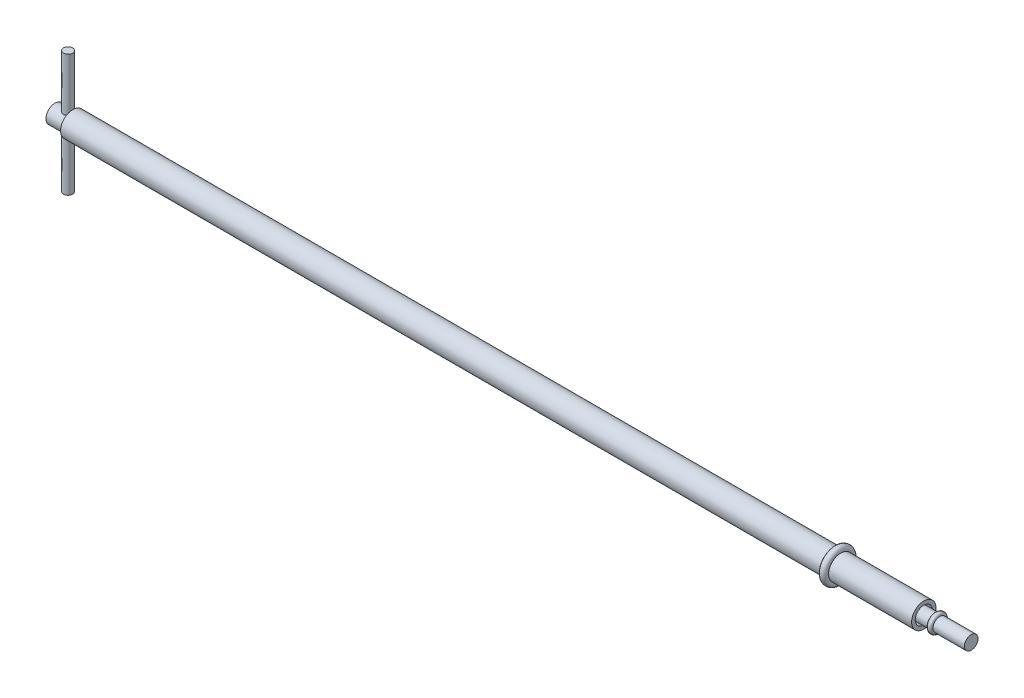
ISO-10303-21;
HEADER;
FILE_DESCRIPTION(('STEP AP214'),'2;1');
FILE_NAME('part.step','',(''),(''),'','','');
FILE_SCHEMA(('AUTOMOTIVE_DESIGN { 1 0 10303 214 1 1 1 1 }'));
ENDSEC;
DATA;
#1=APPLICATION_CONTEXT('core data for automotive mechanical design processes');
#2=APPLICATION_PROTOCOL_DEFINITION('international standard','automotive_design',2000,#1);
#3=PRODUCT_CONTEXT('',#1,'mechanical');
#4=PRODUCT('Part','Part','',(#3));
#5=PRODUCT_RELATED_PRODUCT_CATEGORY('part','',(#4));
#6=PRODUCT_DEFINITION_FORMATION('','',#4);
#7=PRODUCT_DEFINITION_CONTEXT('part definition',#1,'design');
#8=PRODUCT_DEFINITION('design','',#6,#7);
#9=PRODUCT_DEFINITION_SHAPE('','',#8);
#10=(LENGTH_UNIT() NAMED_UNIT(*) SI_UNIT(.MILLI.,.METRE.));
#11=(NAMED_UNIT(*) PLANE_ANGLE_UNIT() SI_UNIT($,.RADIAN.));
#12=(NAMED_UNIT(*) SI_UNIT($,.STERADIAN.) SOLID_ANGLE_UNIT());
#13=UNCERTAINTY_MEASURE_WITH_UNIT(LENGTH_MEASURE(1.E-05),#10,'distance_accuracy_value','');
#14=(GEOMETRIC_REPRESENTATION_CONTEXT(3) GLOBAL_UNCERTAINTY_ASSIGNED_CONTEXT((#13)) GLOBAL_UNIT_ASSIGNED_CONTEXT((#10,
#11,#12)) REPRESENTATION_CONTEXT('',''));
#15=CARTESIAN_POINT('',(0.,0.,0.));
#16=DIRECTION('',(0.,0.,1.));
#17=DIRECTION('',(1.,0.,0.));
#18=AXIS2_PLACEMENT_3D('',#15,#16,#17);
#19=CARTESIAN_POINT('',(0.,0.,0.));
#20=DIRECTION('',(1.,0.,0.));
#21=DIRECTION('',(0.,0.,-1.));
#22=AXIS2_PLACEMENT_3D('',#19,#20,#21);
#23=PLANE('',#22);
#24=CARTESIAN_POINT('',(0.,0.,0.));
#25=DIRECTION('',(-1.,0.,0.));
#26=DIRECTION('',(0.,0.,1.));
#27=AXIS2_PLACEMENT_3D('',#24,#25,#26);
#28=CIRCLE('',#27,2.96848884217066);
#29=CARTESIAN_POINT('',(0.,0.,2.96848884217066));
#30=VERTEX_POINT('',#29);
#31=EDGE_CURVE('E9',#30,#30,#28,.T.);
#32=ORIENTED_EDGE('',*,*,#31,.T.);
#33=EDGE_LOOP('',(#32));
#34=FACE_BOUND('',#33,.T.);
#35=ADVANCED_FACE('F14',(#34),#23,.F.);
#36=CARTESIAN_POINT('',(0.,0.,0.));
#37=DIRECTION('',(-1.,0.,0.));
#38=DIRECTION('',(0.,0.,1.));
#39=AXIS2_PLACEMENT_3D('',#36,#37,#38);
#40=CYLINDRICAL_SURFACE('',#39,2.96848884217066);
#41=CARTESIAN_POINT('',(4.2661907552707,-2.56162565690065,1.5));
#42=CARTESIAN_POINT('',(4.34422264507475,-2.56163267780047,1.4999944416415));
#43=CARTESIAN_POINT('',(4.42235011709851,-2.5652455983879,1.49387019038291));
#44=CARTESIAN_POINT('',(4.57619660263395,-2.57917019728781,1.46969018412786));
#45=CARTESIAN_POINT('',(4.65191032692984,-2.58949565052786,1.45160989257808));
#46=CARTESIAN_POINT('',(4.7984121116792,-2.61534051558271,1.40450365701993));
#47=CARTESIAN_POINT('',(4.86922439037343,-2.63083180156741,1.37553687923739));
#48=CARTESIAN_POINT('',(5.00496574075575,-2.66521903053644,1.3076607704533));
#49=CARTESIAN_POINT('',(5.06989438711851,-2.68411521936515,1.26875072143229));
#50=CARTESIAN_POINT('',(5.1980701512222,-2.72512943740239,1.17824574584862));
#51=CARTESIAN_POINT('',(5.26071360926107,-2.74738478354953,1.12585775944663));
#52=CARTESIAN_POINT('',(5.37679616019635,-2.79150219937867,1.01153200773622));
#53=CARTESIAN_POINT('',(5.43023057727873,-2.81336406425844,0.949589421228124));
#54=CARTESIAN_POINT('',(5.53000027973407,-2.85604040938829,0.812675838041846));
#55=CARTESIAN_POINT('',(5.57558830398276,-2.87667768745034,0.737099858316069));
#56=CARTESIAN_POINT('',(5.65312694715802,-2.91278858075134,0.57811281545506));
#57=CARTESIAN_POINT('',(5.68508635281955,-2.92826552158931,0.494706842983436));
#58=CARTESIAN_POINT('',(5.73205409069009,-2.95132082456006,0.328826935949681));
#59=CARTESIAN_POINT('',(5.74812234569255,-2.95939000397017,0.246722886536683));
#60=CARTESIAN_POINT('',(5.76634693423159,-2.96855664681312,0.0806187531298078));
#61=CARTESIAN_POINT('',(5.76851189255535,-2.96965843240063,-0.00338012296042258));
#62=CARTESIAN_POINT('',(5.75926674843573,-2.96499461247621,-0.162900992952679));
#63=CARTESIAN_POINT('',(5.74904466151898,-2.95982995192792,-0.238513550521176));
#64=CARTESIAN_POINT('',(5.71744812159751,-2.94412744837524,-0.386779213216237));
#65=CARTESIAN_POINT('',(5.69607283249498,-2.93358920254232,-0.459432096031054));
#66=CARTESIAN_POINT('',(5.64265046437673,-2.90792243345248,-0.600967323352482));
#67=CARTESIAN_POINT('',(5.6104622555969,-2.89273345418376,-0.669784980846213));
#68=CARTESIAN_POINT('',(5.53652935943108,-2.85912624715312,-0.801205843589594));
#69=CARTESIAN_POINT('',(5.49478127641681,-2.84070687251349,-0.863806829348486));
#70=CARTESIAN_POINT('',(5.39831355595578,-2.80027310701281,-0.987431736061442));
#71=CARTESIAN_POINT('',(5.34273339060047,-2.77808334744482,-1.04772730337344));
#72=CARTESIAN_POINT('',(5.22247589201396,-2.73373058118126,-1.15853905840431));
#73=CARTESIAN_POINT('',(5.15779137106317,-2.711567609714,-1.20904744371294));
#74=CARTESIAN_POINT('',(5.01595350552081,-2.66818702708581,-1.30211863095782));
#75=CARTESIAN_POINT('',(4.93825943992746,-2.64712790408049,-1.34393869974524));
#76=CARTESIAN_POINT('',(4.77563373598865,-2.61059724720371,-1.41360191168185));
#77=CARTESIAN_POINT('',(4.69070988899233,-2.59511979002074,-1.44145988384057));
#78=CARTESIAN_POINT('',(4.52314660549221,-2.5732516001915,-1.48012245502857));
#79=CARTESIAN_POINT('',(4.44086504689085,-2.5662346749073,-1.4921098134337));
#80=CARTESIAN_POINT('',(4.27518725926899,-2.56030791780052,-1.50226241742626));
#81=CARTESIAN_POINT('',(4.19179190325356,-2.56139207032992,-1.50043791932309));
#82=CARTESIAN_POINT('',(4.0363004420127,-2.57088003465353,-1.48410429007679));
#83=CARTESIAN_POINT('',(3.96399155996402,-2.57844372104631,-1.47105036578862));
#84=CARTESIAN_POINT('',(3.82273455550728,-2.5987858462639,-1.43480545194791));
#85=CARTESIAN_POINT('',(3.75378756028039,-2.61156602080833,-1.4116110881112));
#86=CARTESIAN_POINT('',(3.61758262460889,-2.64158935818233,-1.35462537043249));
#87=CARTESIAN_POINT('',(3.55054962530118,-2.65901132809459,-1.32039421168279));
#88=CARTESIAN_POINT('',(3.4227891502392,-2.69620279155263,-1.24268708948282));
#89=CARTESIAN_POINT('',(3.36206494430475,-2.71597349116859,-1.19920636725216));
#90=CARTESIAN_POINT('',(3.24042974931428,-2.75870627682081,-1.09766735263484));
#91=CARTESIAN_POINT('',(3.18050972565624,-2.78175048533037,-1.03845113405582));
#92=CARTESIAN_POINT('',(3.07113715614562,-2.82623083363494,-0.910458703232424));
#93=CARTESIAN_POINT('',(3.02168838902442,-2.84766639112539,-0.841679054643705));
#94=CARTESIAN_POINT('',(2.93345142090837,-2.88730330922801,-0.693843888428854));
#95=CARTESIAN_POINT('',(2.89500808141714,-2.90539479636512,-0.61455096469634));
#96=CARTESIAN_POINT('',(2.83239387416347,-2.93546253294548,-0.449446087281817));
#97=CARTESIAN_POINT('',(2.80821021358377,-2.94744426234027,-0.363640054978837));
#98=CARTESIAN_POINT('',(2.77692709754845,-2.96305064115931,-0.196555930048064));
#99=CARTESIAN_POINT('',(2.76844828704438,-2.96734871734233,-0.115598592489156));
#100=CARTESIAN_POINT('',(2.76472481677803,-2.96922900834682,0.046686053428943));
#101=CARTESIAN_POINT('',(2.76947531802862,-2.96681367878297,0.128013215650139));
#102=CARTESIAN_POINT('',(2.79117351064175,-2.95593044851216,0.282881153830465));
#103=CARTESIAN_POINT('',(2.80726716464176,-2.94788661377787,0.356574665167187));
#104=CARTESIAN_POINT('',(2.8500269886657,-2.92696073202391,0.500089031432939));
#105=CARTESIAN_POINT('',(2.87669464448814,-2.91407800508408,0.569909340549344));
#106=CARTESIAN_POINT('',(2.94100554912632,-2.88395591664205,0.70700699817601));
#107=CARTESIAN_POINT('',(2.97906392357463,-2.86655585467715,0.774053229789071));
#108=CARTESIAN_POINT('',(3.06455784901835,-2.82919949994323,0.901081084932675));
#109=CARTESIAN_POINT('',(3.11199768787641,-2.80924203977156,0.961059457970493));
#110=CARTESIAN_POINT('',(3.2204757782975,-2.76635443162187,1.0786621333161));
#111=CARTESIAN_POINT('',(3.28240495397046,-2.74332800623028,1.13543169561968));
#112=CARTESIAN_POINT('',(3.41521608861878,-2.69855126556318,1.23810027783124));
#113=CARTESIAN_POINT('',(3.48610617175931,-2.67680213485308,1.28398932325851));
#114=CARTESIAN_POINT('',(3.63807370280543,-2.63645767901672,1.36496837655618));
#115=CARTESIAN_POINT('',(3.71942032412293,-2.61799889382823,1.39962566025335));
#116=CARTESIAN_POINT('',(3.88798624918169,-2.5880823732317,1.45421765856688));
#117=CARTESIAN_POINT('',(3.97518486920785,-2.57660128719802,1.47420152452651));
#118=CARTESIAN_POINT('',(4.09717142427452,-2.56697512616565,1.49083314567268));
#119=CARTESIAN_POINT('',(4.13084530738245,-2.56497652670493,1.49426512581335));
#120=CARTESIAN_POINT('',(4.1984036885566,-2.56230022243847,1.49884983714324));
#121=CARTESIAN_POINT('',(4.23228820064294,-2.56162260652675,1.50000241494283));
#122=CARTESIAN_POINT('',(4.2661907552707,-2.56162565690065,1.5));
#123=B_SPLINE_CURVE_WITH_KNOTS('',3,(#41,#42,#43,#44,#45,#46,#47,#48,#49,#50,#51,#52,#53,#54,
#55,#56,#57,#58,#59,#60,#61,#62,#63,#64,#65,#66,#67,#68,#69,#70,#71,#72,#73,#74,#75,#76,#77,#78,
#79,#80,#81,#82,#83,#84,#85,#86,#87,#88,#89,#90,#91,#92,#93,#94,#95,#96,#97,#98,#99,#100,#101,
#102,#103,#104,#105,#106,#107,#108,#109,#110,#111,#112,#113,#114,#115,#116,#117,#118,#119,#120,
#121,#122),.UNSPECIFIED.,.T.,.F.,(4,2,2,2,2,2,2,2,2,2,2,2,2,2,2,2,2,2,2,2,2,2,2,2,2,2,2,2,2,2,2,
2,2,2,2,2,2,2,2,2,4),(0.,0.233952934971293,0.468387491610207,0.701565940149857,
0.934761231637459,1.18762397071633,1.44061472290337,1.71111458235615,1.98143977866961,
2.2321892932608,2.48278324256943,2.71113163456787,2.93949714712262,3.17096723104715,
3.40251966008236,3.65630154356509,3.91028491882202,4.18100181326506,4.45143056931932,
4.70029410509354,4.94897285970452,5.16957851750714,5.39025763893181,5.62112511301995,
5.85211165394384,6.11296325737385,6.37390883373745,6.64230820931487,6.91046642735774,
7.15369256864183,7.39682975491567,7.62338321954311,7.84996852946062,8.08610136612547,
8.32234237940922,8.58252752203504,8.8429502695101,9.1124607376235,9.38106425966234,
9.48270307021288,9.58434872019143),.UNSPECIFIED.);
#124=CARTESIAN_POINT('',(4.2661907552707,-2.56162565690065,1.5));
#125=VERTEX_POINT('',#124);
#126=EDGE_CURVE('E17',#125,#125,#123,.T.);
#127=ORIENTED_EDGE('',*,*,#126,.T.);
#128=EDGE_LOOP('',(#127));
#129=FACE_BOUND('',#128,.T.);
#130=CARTESIAN_POINT('',(4.2661907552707,2.56162565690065,1.5));
#131=CARTESIAN_POINT('',(4.18815886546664,2.56163267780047,1.4999944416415));
#132=CARTESIAN_POINT('',(4.11003139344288,2.5652455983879,1.49387019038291));
#133=CARTESIAN_POINT('',(3.95618490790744,2.57917019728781,1.46969018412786));
#134=CARTESIAN_POINT('',(3.88047118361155,2.58949565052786,1.45160989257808));
#135=CARTESIAN_POINT('',(3.73396939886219,2.61534051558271,1.40450365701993));
#136=CARTESIAN_POINT('',(3.66315712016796,2.63083180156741,1.37553687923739));
#137=CARTESIAN_POINT('',(3.52741576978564,2.66521903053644,1.3076607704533));
#138=CARTESIAN_POINT('',(3.46248712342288,2.68411521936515,1.26875072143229));
#139=CARTESIAN_POINT('',(3.33431135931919,2.72512943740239,1.17824574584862));
#140=CARTESIAN_POINT('',(3.27166790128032,2.74738478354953,1.12585775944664));
#141=CARTESIAN_POINT('',(3.15558535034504,2.79150219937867,1.01153200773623));
#142=CARTESIAN_POINT('',(3.10215093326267,2.81336406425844,0.949589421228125));
#143=CARTESIAN_POINT('',(3.00238123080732,2.85604040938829,0.812675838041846));
#144=CARTESIAN_POINT('',(2.95679320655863,2.87667768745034,0.73709985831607));
#145=CARTESIAN_POINT('',(2.87925456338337,2.91278858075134,0.578112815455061));
#146=CARTESIAN_POINT('',(2.84729515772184,2.92826552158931,0.494706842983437));
#147=CARTESIAN_POINT('',(2.8003274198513,2.95132082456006,0.328826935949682));
#148=CARTESIAN_POINT('',(2.78425916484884,2.95939000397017,0.246722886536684));
#149=CARTESIAN_POINT('',(2.7660345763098,2.96855664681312,0.0806187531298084));
#150=CARTESIAN_POINT('',(2.76386961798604,2.96965843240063,-0.00338012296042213));
#151=CARTESIAN_POINT('',(2.77311476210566,2.96499461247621,-0.162900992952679));
#152=CARTESIAN_POINT('',(2.78333684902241,2.95982995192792,-0.238513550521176));
#153=CARTESIAN_POINT('',(2.81493338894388,2.94412744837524,-0.386779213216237));
#154=CARTESIAN_POINT('',(2.83630867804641,2.93358920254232,-0.459432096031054));
#155=CARTESIAN_POINT('',(2.88973104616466,2.90792243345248,-0.600967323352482));
#156=CARTESIAN_POINT('',(2.92191925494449,2.89273345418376,-0.669784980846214));
#157=CARTESIAN_POINT('',(2.99585215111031,2.85912624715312,-0.801205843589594));
#158=CARTESIAN_POINT('',(3.03760023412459,2.84070687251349,-0.863806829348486));
#159=CARTESIAN_POINT('',(3.13406795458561,2.80027310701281,-0.987431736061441));
#160=CARTESIAN_POINT('',(3.18964811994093,2.77808334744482,-1.04772730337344));
#161=CARTESIAN_POINT('',(3.30990561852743,2.73373058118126,-1.15853905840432));
#162=CARTESIAN_POINT('',(3.37459013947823,2.711567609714,-1.20904744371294));
#163=CARTESIAN_POINT('',(3.51642800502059,2.66818702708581,-1.30211863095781));
#164=CARTESIAN_POINT('',(3.59412207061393,2.64712790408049,-1.34393869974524));
#165=CARTESIAN_POINT('',(3.75674777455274,2.6105972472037,-1.41360191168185));
#166=CARTESIAN_POINT('',(3.84167162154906,2.59511979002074,-1.44145988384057));
#167=CARTESIAN_POINT('',(4.00923490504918,2.5732516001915,-1.48012245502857));
#168=CARTESIAN_POINT('',(4.09151646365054,2.5662346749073,-1.4921098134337));
#169=CARTESIAN_POINT('',(4.2571942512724,2.56030791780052,-1.50226241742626));
#170=CARTESIAN_POINT('',(4.34058960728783,2.56139207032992,-1.50043791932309));
#171=CARTESIAN_POINT('',(4.49608106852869,2.57088003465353,-1.48410429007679));
#172=CARTESIAN_POINT('',(4.56838995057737,2.57844372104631,-1.47105036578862));
#173=CARTESIAN_POINT('',(4.70964695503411,2.59878584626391,-1.43480545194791));
#174=CARTESIAN_POINT('',(4.77859395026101,2.61156602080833,-1.4116110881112));
#175=CARTESIAN_POINT('',(4.9147988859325,2.64158935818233,-1.35462537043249));
#176=CARTESIAN_POINT('',(4.98183188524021,2.65901132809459,-1.32039421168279));
#177=CARTESIAN_POINT('',(5.10959236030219,2.69620279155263,-1.24268708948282));
#178=CARTESIAN_POINT('',(5.17031656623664,2.71597349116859,-1.19920636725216));
#179=CARTESIAN_POINT('',(5.29195176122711,2.75870627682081,-1.09766735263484));
#180=CARTESIAN_POINT('',(5.35187178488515,2.78175048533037,-1.03845113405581));
#181=CARTESIAN_POINT('',(5.46124435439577,2.82623083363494,-0.910458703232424));
#182=CARTESIAN_POINT('',(5.51069312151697,2.84766639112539,-0.841679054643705));
#183=CARTESIAN_POINT('',(5.59893008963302,2.88730330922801,-0.693843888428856));
#184=CARTESIAN_POINT('',(5.63737342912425,2.90539479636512,-0.614550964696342));
#185=CARTESIAN_POINT('',(5.69998763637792,2.93546253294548,-0.449446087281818));
#186=CARTESIAN_POINT('',(5.72417129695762,2.94744426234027,-0.363640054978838));
#187=CARTESIAN_POINT('',(5.75545441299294,2.96305064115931,-0.196555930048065));
#188=CARTESIAN_POINT('',(5.76393322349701,2.96734871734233,-0.115598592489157));
#189=CARTESIAN_POINT('',(5.76765669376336,2.96922900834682,0.0466860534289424));
#190=CARTESIAN_POINT('',(5.76290619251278,2.96681367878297,0.128013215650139));
#191=CARTESIAN_POINT('',(5.74120799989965,2.95593044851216,0.282881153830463));
#192=CARTESIAN_POINT('',(5.72511434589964,2.94788661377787,0.356574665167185));
#193=CARTESIAN_POINT('',(5.68235452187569,2.92696073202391,0.500089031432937));
#194=CARTESIAN_POINT('',(5.65568686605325,2.91407800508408,0.569909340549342));
#195=CARTESIAN_POINT('',(5.59137596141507,2.88395591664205,0.707006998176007));
#196=CARTESIAN_POINT('',(5.55331758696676,2.86655585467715,0.774053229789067));
#197=CARTESIAN_POINT('',(5.46782366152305,2.82919949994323,0.901081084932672));
#198=CARTESIAN_POINT('',(5.42038382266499,2.80924203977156,0.961059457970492));
#199=CARTESIAN_POINT('',(5.3119057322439,2.76635443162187,1.0786621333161));
#200=CARTESIAN_POINT('',(5.24997655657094,2.74332800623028,1.13543169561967));
#201=CARTESIAN_POINT('',(5.11716542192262,2.69855126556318,1.23810027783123));
#202=CARTESIAN_POINT('',(5.04627533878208,2.67680213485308,1.28398932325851));
#203=CARTESIAN_POINT('',(4.89430780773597,2.63645767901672,1.36496837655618));
#204=CARTESIAN_POINT('',(4.81296118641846,2.61799889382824,1.39962566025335));
#205=CARTESIAN_POINT('',(4.6443952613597,2.5880823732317,1.45421765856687));
#206=CARTESIAN_POINT('',(4.55719664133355,2.57660128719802,1.47420152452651));
#207=CARTESIAN_POINT('',(4.43521008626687,2.56697512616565,1.49083314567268));
#208=CARTESIAN_POINT('',(4.40153620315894,2.56497652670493,1.49426512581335));
#209=CARTESIAN_POINT('',(4.33397782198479,2.56230022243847,1.49884983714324));
#210=CARTESIAN_POINT('',(4.30009330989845,2.56162260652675,1.50000241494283));
#211=CARTESIAN_POINT('',(4.2661907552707,2.56162565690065,1.5));
#212=B_SPLINE_CURVE_WITH_KNOTS('',3,(#130,#131,#132,#133,#134,#135,#136,#137,#138,#139,#140,
#141,#142,#143,#144,#145,#146,#147,#148,#149,#150,#151,#152,#153,#154,#155,#156,#157,#158,#159,
#160,#161,#162,#163,#164,#165,#166,#167,#168,#169,#170,#171,#172,#173,#174,#175,#176,#177,#178,
#179,#180,#181,#182,#183,#184,#185,#186,#187,#188,#189,#190,#191,#192,#193,#194,#195,#196,#197,
#198,#199,#200,#201,#202,#203,#204,#205,#206,#207,#208,#209,#210,#211),.UNSPECIFIED.,.T.,.F.,(4,
2,2,2,2,2,2,2,2,2,2,2,2,2,2,2,2,2,2,2,2,2,2,2,2,2,2,2,2,2,2,2,2,2,2,2,2,2,2,2,4),(0.,
0.233952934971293,0.468387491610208,0.701565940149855,0.934761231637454,1.18762397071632,
1.44061472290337,1.71111458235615,1.98143977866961,2.2321892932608,2.48278324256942,
2.71113163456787,2.93949714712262,3.17096723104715,3.40251966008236,3.65630154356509,
3.91028491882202,4.18100181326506,4.45143056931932,4.70029410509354,4.94897285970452,
5.16957851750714,5.39025763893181,5.62112511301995,5.85211165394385,6.11296325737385,
6.37390883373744,6.64230820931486,6.91046642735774,7.15369256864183,7.39682975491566,
7.62338321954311,7.84996852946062,8.08610136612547,8.32234237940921,8.58252752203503,
8.8429502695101,9.1124607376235,9.38106425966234,9.48270307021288,9.58434872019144),.UNSPECIFIED.);
#213=CARTESIAN_POINT('',(4.2661907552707,2.56162565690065,1.5));
#214=VERTEX_POINT('',#213);
#215=EDGE_CURVE('E33',#214,#214,#212,.T.);
#216=ORIENTED_EDGE('',*,*,#215,.T.);
#217=EDGE_LOOP('',(#216));
#218=FACE_BOUND('',#217,.T.);
#219=ORIENTED_EDGE('',*,*,#31,.F.);
#220=EDGE_LOOP('',(#219));
#221=FACE_BOUND('',#220,.T.);
#222=CARTESIAN_POINT('',(5.7989899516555,0.,0.));
#223=DIRECTION('',(-1.,0.,0.));
#224=DIRECTION('',(0.,0.,1.));
#225=AXIS2_PLACEMENT_3D('',#222,#223,#224);
#226=CIRCLE('',#225,2.96848884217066);
#227=CARTESIAN_POINT('',(5.7989899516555,0.,2.96848884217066));
#228=VERTEX_POINT('',#227);
#229=EDGE_CURVE('E25',#228,#228,#226,.T.);
#230=ORIENTED_EDGE('',*,*,#229,.T.);
#231=EDGE_LOOP('',(#230));
#232=FACE_BOUND('',#231,.T.);
#233=ADVANCED_FACE('F39',(#129,#218,#221,#232),#40,.T.);
#234=CARTESIAN_POINT('',(5.7989899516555,2.96848884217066,0.));
#235=DIRECTION('',(1.,0.,0.));
#236=DIRECTION('',(0.,0.,-1.));
#237=AXIS2_PLACEMENT_3D('',#234,#235,#236);
#238=PLANE('',#237);
#239=ORIENTED_EDGE('',*,*,#229,.F.);
#240=EDGE_LOOP('',(#239));
#241=FACE_BOUND('',#240,.T.);
#242=CARTESIAN_POINT('',(5.7989899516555,0.,0.));
#243=DIRECTION('',(-1.,0.,0.));
#244=DIRECTION('',(0.,0.,1.));
#245=AXIS2_PLACEMENT_3D('',#242,#243,#244);
#246=CIRCLE('',#245,4.);
#247=CARTESIAN_POINT('',(5.7989899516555,0.,4.));
#248=VERTEX_POINT('',#247);
#249=EDGE_CURVE('E30',#248,#248,#246,.T.);
#250=ORIENTED_EDGE('',*,*,#249,.T.);
#251=EDGE_LOOP('',(#250));
#252=FACE_BOUND('',#251,.T.);
#253=ADVANCED_FACE('F91',(#241,#252),#238,.F.);
#254=CARTESIAN_POINT('',(0.,0.,0.));
#255=DIRECTION('',(-1.,0.,0.));
#256=DIRECTION('',(0.,0.,1.));
#257=AXIS2_PLACEMENT_3D('',#254,#255,#256);
#258=CYLINDRICAL_SURFACE('',#257,4.);
#259=ORIENTED_EDGE('',*,*,#249,.F.);
#260=EDGE_LOOP('',(#259));
#261=FACE_BOUND('',#260,.T.);
#262=CARTESIAN_POINT('',(255.262918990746,0.,0.));
#263=DIRECTION('',(-1.,0.,0.));
#264=DIRECTION('',(0.,0.,1.));
#265=AXIS2_PLACEMENT_3D('',#262,#263,#264);
#266=CIRCLE('',#265,4.);
#267=CARTESIAN_POINT('',(255.262918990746,0.,4.));
#268=VERTEX_POINT('',#267);
#269=EDGE_CURVE('E246',#268,#268,#266,.T.);
#270=ORIENTED_EDGE('',*,*,#269,.T.);
#271=EDGE_LOOP('',(#270));
#272=FACE_BOUND('',#271,.T.);
#273=ADVANCED_FACE('F88',(#261,#272),#258,.T.);
#274=CARTESIAN_POINT('',(256.279592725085,0.,0.));
#275=DIRECTION('',(-1.,0.,0.));
#276=DIRECTION('',(0.,0.,1.));
#277=AXIS2_PLACEMENT_3D('',#274,#275,#276);
#278=TOROIDAL_SURFACE('',#277,4.45662602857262,1.11451012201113);
#279=ORIENTED_EDGE('',*,*,#269,.F.);
#280=EDGE_LOOP('',(#279));
#281=FACE_BOUND('',#280,.T.);
#282=CARTESIAN_POINT('',(257.296266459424,0.,0.));
#283=DIRECTION('',(-1.,0.,0.));
#284=DIRECTION('',(0.,0.,1.));
#285=AXIS2_PLACEMENT_3D('',#282,#283,#284);
#286=CIRCLE('',#285,4.);
#287=CARTESIAN_POINT('',(257.296266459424,0.,4.));
#288=VERTEX_POINT('',#287);
#289=EDGE_CURVE('E243',#288,#288,#286,.T.);
#290=ORIENTED_EDGE('',*,*,#289,.T.);
#291=EDGE_LOOP('',(#290));
#292=FACE_BOUND('',#291,.T.);
#293=ADVANCED_FACE('F84',(#281,#292),#278,.T.);
#294=CARTESIAN_POINT('',(0.,0.,0.));
#295=DIRECTION('',(-1.,0.,0.));
#296=DIRECTION('',(0.,0.,1.));
#297=AXIS2_PLACEMENT_3D('',#294,#295,#296);
#298=CYLINDRICAL_SURFACE('',#297,4.);
#299=ORIENTED_EDGE('',*,*,#289,.F.);
#300=EDGE_LOOP('',(#299));
#301=FACE_BOUND('',#300,.T.);
#302=CARTESIAN_POINT('',(284.483646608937,0.,0.));
#303=DIRECTION('',(-1.,0.,0.));
#304=DIRECTION('',(0.,0.,1.));
#305=AXIS2_PLACEMENT_3D('',#302,#303,#304);
#306=CIRCLE('',#305,4.);
#307=CARTESIAN_POINT('',(284.483646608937,0.,4.));
#308=VERTEX_POINT('',#307);
#309=EDGE_CURVE('E240',#308,#308,#306,.T.);
#310=ORIENTED_EDGE('',*,*,#309,.T.);
#311=EDGE_LOOP('',(#310));
#312=FACE_BOUND('',#311,.T.);
#313=ADVANCED_FACE('F80',(#301,#312),#298,.T.);
#314=CARTESIAN_POINT('',(284.483646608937,4.,0.));
#315=DIRECTION('',(-1.,0.,0.));
#316=DIRECTION('',(0.,0.,1.));
#317=AXIS2_PLACEMENT_3D('',#314,#315,#316);
#318=PLANE('',#317);
#319=ORIENTED_EDGE('',*,*,#309,.F.);
#320=EDGE_LOOP('',(#319));
#321=FACE_BOUND('',#320,.T.);
#322=CARTESIAN_POINT('',(284.483646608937,0.,0.));
#323=DIRECTION('',(-1.,0.,0.));
#324=DIRECTION('',(0.,0.,1.));
#325=AXIS2_PLACEMENT_3D('',#322,#323,#324);
#326=CIRCLE('',#325,2.81549285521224);
#327=CARTESIAN_POINT('',(284.483646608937,0.,2.81549285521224));
#328=VERTEX_POINT('',#327);
#329=EDGE_CURVE('E237',#328,#328,#326,.T.);
#330=ORIENTED_EDGE('',*,*,#329,.T.);
#331=EDGE_LOOP('',(#330));
#332=FACE_BOUND('',#331,.T.);
#333=ADVANCED_FACE('F76',(#321,#332),#318,.F.);
#334=CARTESIAN_POINT('',(0.,0.,0.));
#335=DIRECTION('',(-1.,0.,0.));
#336=DIRECTION('',(0.,0.,1.));
#337=AXIS2_PLACEMENT_3D('',#334,#335,#336);
#338=CYLINDRICAL_SURFACE('',#337,2.81549285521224);
#339=ORIENTED_EDGE('',*,*,#329,.F.);
#340=EDGE_LOOP('',(#339));
#341=FACE_BOUND('',#340,.T.);
#342=CARTESIAN_POINT('',(280.736974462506,0.,0.));
#343=DIRECTION('',(-1.,0.,0.));
#344=DIRECTION('',(0.,0.,1.));
#345=AXIS2_PLACEMENT_3D('',#342,#343,#344);
#346=CIRCLE('',#345,2.81549285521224);
#347=CARTESIAN_POINT('',(280.736974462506,0.,2.81549285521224));
#348=VERTEX_POINT('',#347);
#349=EDGE_CURVE('E234',#348,#348,#346,.T.);
#350=ORIENTED_EDGE('',*,*,#349,.T.);
#351=EDGE_LOOP('',(#350));
#352=FACE_BOUND('',#351,.T.);
#353=ADVANCED_FACE('F72',(#341,#352),#338,.F.);
#354=CARTESIAN_POINT('',(280.736974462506,2.81549285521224,0.));
#355=DIRECTION('',(-1.,0.,0.));
#356=DIRECTION('',(0.,0.,1.));
#357=AXIS2_PLACEMENT_3D('',#354,#355,#356);
#358=PLANE('',#357);
#359=ORIENTED_EDGE('',*,*,#349,.F.);
#360=EDGE_LOOP('',(#359));
#361=FACE_BOUND('',#360,.T.);
#362=CARTESIAN_POINT('',(280.736974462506,0.,0.));
#363=DIRECTION('',(-1.,0.,0.));
#364=DIRECTION('',(0.,0.,1.));
#365=AXIS2_PLACEMENT_3D('',#362,#363,#364);
#366=CIRCLE('',#365,2.23252251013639);
#367=CARTESIAN_POINT('',(280.736974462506,0.,2.23252251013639));
#368=VERTEX_POINT('',#367);
#369=EDGE_CURVE('E231',#368,#368,#366,.T.);
#370=ORIENTED_EDGE('',*,*,#369,.T.);
#371=EDGE_LOOP('',(#370));
#372=FACE_BOUND('',#371,.T.);
#373=ADVANCED_FACE('F68',(#361,#372),#358,.F.);
#374=CARTESIAN_POINT('',(0.,0.,0.));
#375=DIRECTION('',(-1.,0.,0.));
#376=DIRECTION('',(0.,0.,1.));
#377=AXIS2_PLACEMENT_3D('',#374,#375,#376);
#378=CYLINDRICAL_SURFACE('',#377,2.23252251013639);
#379=ORIENTED_EDGE('',*,*,#369,.F.);
#380=EDGE_LOOP('',(#379));
#381=FACE_BOUND('',#380,.T.);
#382=CARTESIAN_POINT('',(288.128988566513,0.,0.));
#383=DIRECTION('',(-1.,0.,0.));
#384=DIRECTION('',(0.,0.,1.));
#385=AXIS2_PLACEMENT_3D('',#382,#383,#384);
#386=CIRCLE('',#385,2.23252251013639);
#387=CARTESIAN_POINT('',(288.128988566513,0.,2.23252251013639));
#388=VERTEX_POINT('',#387);
#389=EDGE_CURVE('E228',#388,#388,#386,.T.);
#390=ORIENTED_EDGE('',*,*,#389,.T.);
#391=EDGE_LOOP('',(#390));
#392=FACE_BOUND('',#391,.T.);
#393=ADVANCED_FACE('F64',(#381,#392),#378,.T.);
#394=CARTESIAN_POINT('',(288.919773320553,0.,0.));
#395=DIRECTION('',(-1.,0.,0.));
#396=DIRECTION('',(0.,0.,1.));
#397=AXIS2_PLACEMENT_3D('',#394,#395,#396);
#398=TOROIDAL_SURFACE('',#397,2.23252251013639,0.79078475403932);
#399=ORIENTED_EDGE('',*,*,#389,.F.);
#400=EDGE_LOOP('',(#399));
#401=FACE_BOUND('',#400,.T.);
#402=CARTESIAN_POINT('',(289.710558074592,0.,0.));
#403=DIRECTION('',(-1.,0.,0.));
#404=DIRECTION('',(0.,0.,1.));
#405=AXIS2_PLACEMENT_3D('',#402,#403,#404);
#406=CIRCLE('',#405,2.23252251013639);
#407=CARTESIAN_POINT('',(289.710558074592,0.,2.23252251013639));
#408=VERTEX_POINT('',#407);
#409=EDGE_CURVE('E225',#408,#408,#406,.T.);
#410=ORIENTED_EDGE('',*,*,#409,.T.);
#411=EDGE_LOOP('',(#410));
#412=FACE_BOUND('',#411,.T.);
#413=ADVANCED_FACE('F60',(#401,#412),#398,.T.);
#414=CARTESIAN_POINT('',(0.,0.,0.));
#415=DIRECTION('',(-1.,0.,0.));
#416=DIRECTION('',(0.,0.,1.));
#417=AXIS2_PLACEMENT_3D('',#414,#415,#416);
#418=CYLINDRICAL_SURFACE('',#417,2.23252251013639);
#419=ORIENTED_EDGE('',*,*,#409,.F.);
#420=EDGE_LOOP('',(#419));
#421=FACE_BOUND('',#420,.T.);
#422=CARTESIAN_POINT('',(300.,0.,0.));
#423=DIRECTION('',(-1.,0.,0.));
#424=DIRECTION('',(0.,0.,1.));
#425=AXIS2_PLACEMENT_3D('',#422,#423,#424);
#426=CIRCLE('',#425,2.23252251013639);
#427=CARTESIAN_POINT('',(300.,0.,2.23252251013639));
#428=VERTEX_POINT('',#427);
#429=EDGE_CURVE('E222',#428,#428,#426,.T.);
#430=ORIENTED_EDGE('',*,*,#429,.T.);
#431=EDGE_LOOP('',(#430));
#432=FACE_BOUND('',#431,.T.);
#433=ADVANCED_FACE('F56',(#421,#432),#418,.T.);
#434=CARTESIAN_POINT('',(300.,2.23252251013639,0.));
#435=DIRECTION('',(-1.,0.,0.));
#436=DIRECTION('',(0.,0.,1.));
#437=AXIS2_PLACEMENT_3D('',#434,#435,#436);
#438=PLANE('',#437);
#439=ORIENTED_EDGE('',*,*,#429,.F.);
#440=EDGE_LOOP('',(#439));
#441=FACE_BOUND('',#440,.T.);
#442=ADVANCED_FACE('F51',(#441),#438,.F.);
#443=CARTESIAN_POINT('',(4.2661907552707,20.,0.));
#444=DIRECTION('',(0.,1.,0.));
#445=DIRECTION('',(0.,0.,1.));
#446=AXIS2_PLACEMENT_3D('',#443,#444,#445);
#447=PLANE('',#446);
#448=CARTESIAN_POINT('',(4.2661907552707,20.,0.));
#449=DIRECTION('',(0.,1.,0.));
#450=DIRECTION('',(0.,0.,1.));
#451=AXIS2_PLACEMENT_3D('',#448,#449,#450);
#452=CIRCLE('',#451,1.5);
#453=CARTESIAN_POINT('',(4.2661907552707,20.,1.5));
#454=VERTEX_POINT('',#453);
#455=EDGE_CURVE('E217',#454,#454,#452,.T.);
#456=ORIENTED_EDGE('',*,*,#455,.T.);
#457=EDGE_LOOP('',(#456));
#458=FACE_BOUND('',#457,.T.);
#459=ADVANCED_FACE('F55',(#458),#447,.T.);
#460=CARTESIAN_POINT('',(4.2661907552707,-20.,0.));
#461=DIRECTION('',(0.,1.,0.));
#462=DIRECTION('',(0.,0.,1.));
#463=AXIS2_PLACEMENT_3D('',#460,#461,#462);
#464=CYLINDRICAL_SURFACE('',#463,1.5);
#465=ORIENTED_EDGE('',*,*,#455,.F.);
#466=EDGE_LOOP('',(#465));
#467=FACE_BOUND('',#466,.T.);
#468=ORIENTED_EDGE('',*,*,#215,.F.);
#469=EDGE_LOOP('',(#468));
#470=FACE_BOUND('',#469,.T.);
#471=ADVANCED_FACE('F48',(#467,#470),#464,.T.);
#472=CARTESIAN_POINT('',(4.2661907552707,-20.,0.));
#473=DIRECTION('',(0.,1.,0.));
#474=DIRECTION('',(0.,0.,1.));
#475=AXIS2_PLACEMENT_3D('',#472,#473,#474);
#476=CIRCLE('',#475,1.5);
#477=CARTESIAN_POINT('',(4.2661907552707,-20.,1.5));
#478=VERTEX_POINT('',#477);
#479=EDGE_CURVE('E38',#478,#478,#476,.T.);
#480=ORIENTED_EDGE('',*,*,#479,.T.);
#481=EDGE_LOOP('',(#480));
#482=FACE_BOUND('',#481,.T.);
#483=ORIENTED_EDGE('',*,*,#126,.F.);
#484=EDGE_LOOP('',(#483));
#485=FACE_BOUND('',#484,.T.);
#486=ADVANCED_FACE('F42',(#482,#485),#464,.T.);
#487=CARTESIAN_POINT('',(4.2661907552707,-20.,0.));
#488=DIRECTION('',(0.,1.,0.));
#489=DIRECTION('',(0.,0.,1.));
#490=AXIS2_PLACEMENT_3D('',#487,#488,#489);
#491=PLANE('',#490);
#492=ORIENTED_EDGE('',*,*,#479,.F.);
#493=EDGE_LOOP('',(#492));
#494=FACE_BOUND('',#493,.T.);
#495=ADVANCED_FACE('F47',(#494),#491,.F.);
#496=CLOSED_SHELL('',(#35,#233,#253,#273,#293,#313,#333,#353,#373,#393,#413,#433,#442,#459,#471,
#486,#495));
#497=MANIFOLD_SOLID_BREP('B1',#496);
#498=ADVANCED_BREP_SHAPE_REPRESENTATION('',(#18,#497),#14);
#499=SHAPE_DEFINITION_REPRESENTATION(#9,#498);
ENDSEC;
END-ISO-10303-21;
